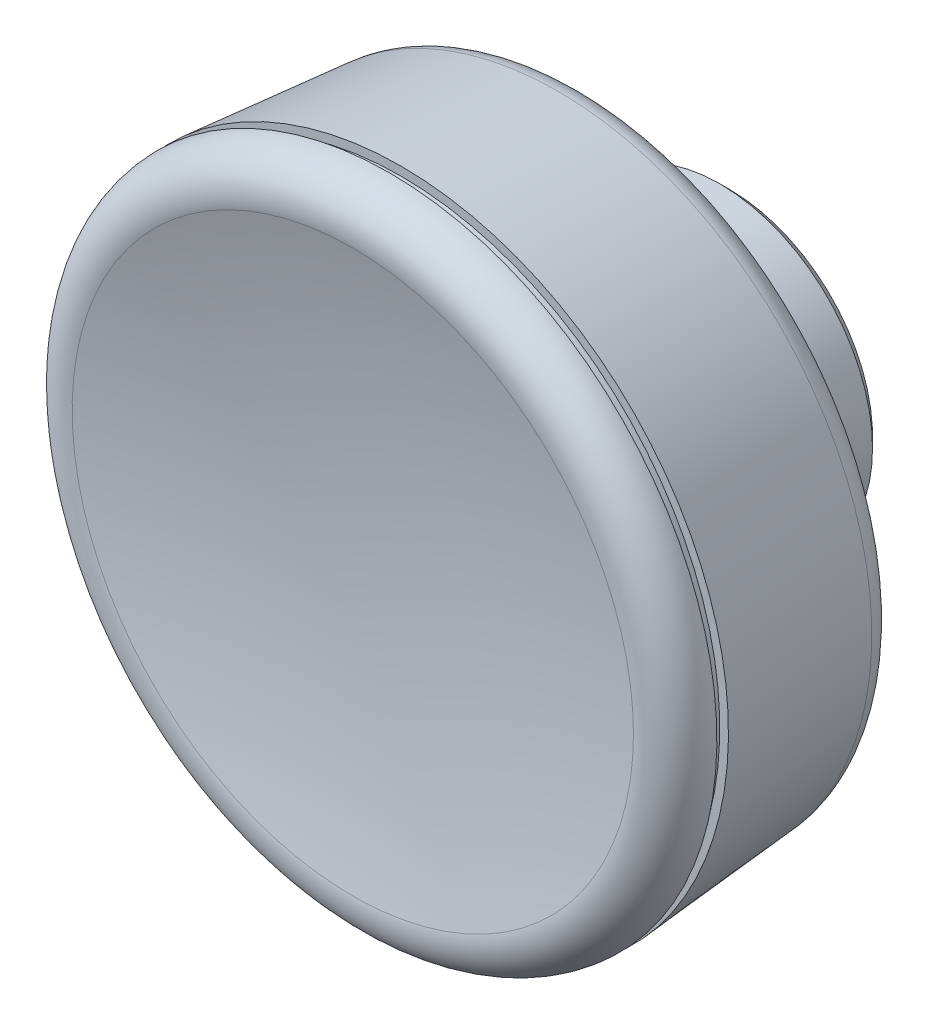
ISO-10303-21;
HEADER;
FILE_DESCRIPTION(('STEP AP214'),'2;1');
FILE_NAME('part.step','',(''),(''),'','','');
FILE_SCHEMA(('AUTOMOTIVE_DESIGN { 1 0 10303 214 1 1 1 1 }'));
ENDSEC;
DATA;
#1=APPLICATION_CONTEXT('core data for automotive mechanical design processes');
#2=APPLICATION_PROTOCOL_DEFINITION('international standard','automotive_design',2000,#1);
#3=PRODUCT_CONTEXT('',#1,'mechanical');
#4=PRODUCT('Part','Part','',(#3));
#5=PRODUCT_RELATED_PRODUCT_CATEGORY('part','',(#4));
#6=PRODUCT_DEFINITION_FORMATION('','',#4);
#7=PRODUCT_DEFINITION_CONTEXT('part definition',#1,'design');
#8=PRODUCT_DEFINITION('design','',#6,#7);
#9=PRODUCT_DEFINITION_SHAPE('','',#8);
#10=(LENGTH_UNIT() NAMED_UNIT(*) SI_UNIT(.MILLI.,.METRE.));
#11=(NAMED_UNIT(*) PLANE_ANGLE_UNIT() SI_UNIT($,.RADIAN.));
#12=(NAMED_UNIT(*) SI_UNIT($,.STERADIAN.) SOLID_ANGLE_UNIT());
#13=UNCERTAINTY_MEASURE_WITH_UNIT(LENGTH_MEASURE(1.E-05),#10,'distance_accuracy_value','');
#14=(GEOMETRIC_REPRESENTATION_CONTEXT(3) GLOBAL_UNCERTAINTY_ASSIGNED_CONTEXT((#13)) GLOBAL_UNIT_ASSIGNED_CONTEXT((#10,
#11,#12)) REPRESENTATION_CONTEXT('',''));
#15=CARTESIAN_POINT('',(0.,0.,0.));
#16=DIRECTION('',(0.,0.,1.));
#17=DIRECTION('',(1.,0.,0.));
#18=AXIS2_PLACEMENT_3D('',#15,#16,#17);
#19=CARTESIAN_POINT('',(0.,0.,106.143396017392));
#20=DIRECTION('',(0.,0.,-1.));
#21=DIRECTION('',(1.,0.,0.));
#22=AXIS2_PLACEMENT_3D('',#19,#20,#21);
#23=SPHERICAL_SURFACE('',#22,82.5);
#24=CARTESIAN_POINT('',(0.,0.,25.9307460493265));
#25=DIRECTION('',(0.,0.,-1.));
#26=DIRECTION('',(0.,1.,0.));
#27=AXIS2_PLACEMENT_3D('',#24,#25,#26);
#28=CIRCLE('',#27,19.2919875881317);
#29=CARTESIAN_POINT('',(0.,19.2919875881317,25.9307460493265));
#30=VERTEX_POINT('',#29);
#31=EDGE_CURVE('E49',#30,#30,#28,.T.);
#32=ORIENTED_EDGE('',*,*,#31,.F.);
#33=EDGE_LOOP('',(#32));
#34=FACE_BOUND('',#33,.T.);
#35=ADVANCED_FACE('F12',(#34),#23,.F.);
#36=CARTESIAN_POINT('',(9.79676461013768,0.,0.));
#37=DIRECTION('',(0.,0.,-1.));
#38=DIRECTION('',(0.,1.,0.));
#39=AXIS2_PLACEMENT_3D('',#36,#37,#38);
#40=PLANE('',#39);
#41=CARTESIAN_POINT('',(0.,0.,0.));
#42=DIRECTION('',(0.,0.,-1.));
#43=DIRECTION('',(0.,1.,0.));
#44=AXIS2_PLACEMENT_3D('',#41,#42,#43);
#45=CIRCLE('',#44,4.);
#46=CARTESIAN_POINT('',(0.,4.,0.));
#47=VERTEX_POINT('',#46);
#48=EDGE_CURVE('E55',#47,#47,#45,.T.);
#49=ORIENTED_EDGE('',*,*,#48,.F.);
#50=EDGE_LOOP('',(#49));
#51=FACE_BOUND('',#50,.T.);
#52=CARTESIAN_POINT('',(0.,0.,0.));
#53=DIRECTION('',(0.,0.,-1.));
#54=DIRECTION('',(0.,1.,0.));
#55=AXIS2_PLACEMENT_3D('',#52,#53,#54);
#56=CIRCLE('',#55,9.79676461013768);
#57=CARTESIAN_POINT('',(0.,9.79676461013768,0.));
#58=VERTEX_POINT('',#57);
#59=EDGE_CURVE('E8',#58,#58,#56,.T.);
#60=ORIENTED_EDGE('',*,*,#59,.T.);
#61=EDGE_LOOP('',(#60));
#62=FACE_BOUND('',#61,.T.);
#63=ADVANCED_FACE('F61',(#51,#62),#40,.T.);
#64=CARTESIAN_POINT('',(0.,0.,0.));
#65=DIRECTION('',(0.,0.,1.));
#66=DIRECTION('',(0.,-1.,0.));
#67=AXIS2_PLACEMENT_3D('',#64,#65,#66);
#68=CONICAL_SURFACE('',#67,9.79676461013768,0.785398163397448);
#69=CARTESIAN_POINT('',(0.,0.,0.700000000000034));
#70=DIRECTION('',(0.,0.,-1.));
#71=DIRECTION('',(0.,1.,0.));
#72=AXIS2_PLACEMENT_3D('',#69,#70,#71);
#73=CIRCLE('',#72,10.4967646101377);
#74=CARTESIAN_POINT('',(0.,10.4967646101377,0.700000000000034));
#75=VERTEX_POINT('',#74);
#76=EDGE_CURVE('E18',#75,#75,#73,.T.);
#77=ORIENTED_EDGE('',*,*,#76,.T.);
#78=EDGE_LOOP('',(#77));
#79=FACE_BOUND('',#78,.T.);
#80=ORIENTED_EDGE('',*,*,#59,.F.);
#81=EDGE_LOOP('',(#80));
#82=FACE_BOUND('',#81,.T.);
#83=ADVANCED_FACE('F63',(#79,#82),#68,.T.);
#84=CARTESIAN_POINT('',(0.,0.,0.));
#85=DIRECTION('',(0.,0.,-1.));
#86=DIRECTION('',(0.,1.,0.));
#87=AXIS2_PLACEMENT_3D('',#84,#85,#86);
#88=CYLINDRICAL_SURFACE('',#87,10.4967646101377);
#89=CARTESIAN_POINT('',(0.,0.,9.06177687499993));
#90=DIRECTION('',(0.,0.,-1.));
#91=DIRECTION('',(0.,1.,0.));
#92=AXIS2_PLACEMENT_3D('',#89,#90,#91);
#93=CIRCLE('',#92,10.4967646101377);
#94=CARTESIAN_POINT('',(0.,10.4967646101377,9.06177687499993));
#95=VERTEX_POINT('',#94);
#96=EDGE_CURVE('E22',#95,#95,#93,.T.);
#97=ORIENTED_EDGE('',*,*,#96,.T.);
#98=EDGE_LOOP('',(#97));
#99=FACE_BOUND('',#98,.T.);
#100=ORIENTED_EDGE('',*,*,#76,.F.);
#101=EDGE_LOOP('',(#100));
#102=FACE_BOUND('',#101,.T.);
#103=ADVANCED_FACE('F70',(#99,#102),#88,.T.);
#104=CARTESIAN_POINT('',(0.,0.,9.06177687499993));
#105=DIRECTION('',(0.,0.,-1.));
#106=DIRECTION('',(0.,1.,0.));
#107=AXIS2_PLACEMENT_3D('',#104,#105,#106);
#108=TOROIDAL_SURFACE('',#107,11.4342646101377,0.937500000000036);
#109=CARTESIAN_POINT('',(0.,0.,9.99927687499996));
#110=DIRECTION('',(0.,0.,-1.));
#111=DIRECTION('',(0.,1.,0.));
#112=AXIS2_PLACEMENT_3D('',#109,#110,#111);
#113=CIRCLE('',#112,11.4342646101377);
#114=CARTESIAN_POINT('',(0.,11.4342646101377,9.99927687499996));
#115=VERTEX_POINT('',#114);
#116=EDGE_CURVE('E26',#115,#115,#113,.T.);
#117=ORIENTED_EDGE('',*,*,#116,.T.);
#118=EDGE_LOOP('',(#117));
#119=FACE_BOUND('',#118,.T.);
#120=ORIENTED_EDGE('',*,*,#96,.F.);
#121=EDGE_LOOP('',(#120));
#122=FACE_BOUND('',#121,.T.);
#123=ADVANCED_FACE('F76',(#119,#122),#108,.F.);
#124=CARTESIAN_POINT('',(11.4342646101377,0.,9.99927687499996));
#125=DIRECTION('',(0.,0.,-1.));
#126=DIRECTION('',(0.,1.,0.));
#127=AXIS2_PLACEMENT_3D('',#124,#125,#126);
#128=PLANE('',#127);
#129=CARTESIAN_POINT('',(0.,0.,9.99927687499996));
#130=DIRECTION('',(0.,0.,-1.));
#131=DIRECTION('',(0.,1.,0.));
#132=AXIS2_PLACEMENT_3D('',#129,#130,#131);
#133=CIRCLE('',#132,19.5827925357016);
#134=CARTESIAN_POINT('',(0.,19.5827925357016,9.99927687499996));
#135=VERTEX_POINT('',#134);
#136=EDGE_CURVE('E31',#135,#135,#133,.T.);
#137=ORIENTED_EDGE('',*,*,#136,.T.);
#138=EDGE_LOOP('',(#137));
#139=FACE_BOUND('',#138,.T.);
#140=ORIENTED_EDGE('',*,*,#116,.F.);
#141=EDGE_LOOP('',(#140));
#142=FACE_BOUND('',#141,.T.);
#143=ADVANCED_FACE('F80',(#139,#142),#128,.T.);
#144=CARTESIAN_POINT('',(0.,0.,12.0082034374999));
#145=DIRECTION('',(0.,0.,-1.));
#146=DIRECTION('',(0.,1.,0.));
#147=AXIS2_PLACEMENT_3D('',#144,#145,#146);
#148=TOROIDAL_SURFACE('',#147,19.5827925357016,2.00892656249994);
#149=CARTESIAN_POINT('',(0.,0.,11.8381158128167));
#150=DIRECTION('',(0.,0.,-1.));
#151=DIRECTION('',(0.,1.,0.));
#152=AXIS2_PLACEMENT_3D('',#149,#150,#151);
#153=CIRCLE('',#152,21.5845058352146);
#154=CARTESIAN_POINT('',(0.,21.5845058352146,11.8381158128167));
#155=VERTEX_POINT('',#154);
#156=EDGE_CURVE('E34',#155,#155,#153,.T.);
#157=ORIENTED_EDGE('',*,*,#156,.T.);
#158=EDGE_LOOP('',(#157));
#159=FACE_BOUND('',#158,.T.);
#160=ORIENTED_EDGE('',*,*,#136,.F.);
#161=EDGE_LOOP('',(#160));
#162=FACE_BOUND('',#161,.T.);
#163=ADVANCED_FACE('F84',(#159,#162),#148,.T.);
#164=CARTESIAN_POINT('',(0.,0.,11.8381158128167));
#165=DIRECTION('',(0.,0.,1.));
#166=DIRECTION('',(0.,-1.,0.));
#167=AXIS2_PLACEMENT_3D('',#164,#165,#166);
#168=CONICAL_SURFACE('',#167,21.5845058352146,0.0847674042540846);
#169=CARTESIAN_POINT('',(0.,0.,22.6056900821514));
#170=DIRECTION('',(0.,0.,-1.));
#171=DIRECTION('',(0.,1.,0.));
#172=AXIS2_PLACEMENT_3D('',#169,#170,#171);
#173=CIRCLE('',#172,22.4994376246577);
#174=CARTESIAN_POINT('',(0.,22.4994376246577,22.6056900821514));
#175=VERTEX_POINT('',#174);
#176=EDGE_CURVE('E37',#175,#175,#173,.T.);
#177=ORIENTED_EDGE('',*,*,#176,.T.);
#178=EDGE_LOOP('',(#177));
#179=FACE_BOUND('',#178,.T.);
#180=ORIENTED_EDGE('',*,*,#156,.F.);
#181=EDGE_LOOP('',(#180));
#182=FACE_BOUND('',#181,.T.);
#183=ADVANCED_FACE('F88',(#179,#182),#168,.T.);
#184=CARTESIAN_POINT('',(21.9,0.,22.6056900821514));
#185=DIRECTION('',(0.,0.,1.));
#186=DIRECTION('',(0.,-1.,0.));
#187=AXIS2_PLACEMENT_3D('',#184,#185,#186);
#188=PLANE('',#187);
#189=CARTESIAN_POINT('',(0.,0.,22.6056900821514));
#190=DIRECTION('',(0.,0.,-1.));
#191=DIRECTION('',(0.,1.,0.));
#192=AXIS2_PLACEMENT_3D('',#189,#190,#191);
#193=CIRCLE('',#192,21.9);
#194=CARTESIAN_POINT('',(0.,21.9,22.6056900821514));
#195=VERTEX_POINT('',#194);
#196=EDGE_CURVE('E40',#195,#195,#193,.T.);
#197=ORIENTED_EDGE('',*,*,#196,.T.);
#198=EDGE_LOOP('',(#197));
#199=FACE_BOUND('',#198,.T.);
#200=ORIENTED_EDGE('',*,*,#176,.F.);
#201=EDGE_LOOP('',(#200));
#202=FACE_BOUND('',#201,.T.);
#203=ADVANCED_FACE('F92',(#199,#202),#188,.T.);
#204=CARTESIAN_POINT('',(0.,0.,0.));
#205=DIRECTION('',(0.,0.,-1.));
#206=DIRECTION('',(0.,1.,0.));
#207=AXIS2_PLACEMENT_3D('',#204,#205,#206);
#208=CYLINDRICAL_SURFACE('',#207,21.9);
#209=CARTESIAN_POINT('',(0.,0.,23.4028322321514));
#210=DIRECTION('',(0.,0.,-1.));
#211=DIRECTION('',(0.,1.,0.));
#212=AXIS2_PLACEMENT_3D('',#209,#210,#211);
#213=CIRCLE('',#212,21.9);
#214=CARTESIAN_POINT('',(0.,21.9,23.4028322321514));
#215=VERTEX_POINT('',#214);
#216=EDGE_CURVE('E43',#215,#215,#213,.T.);
#217=ORIENTED_EDGE('',*,*,#216,.T.);
#218=EDGE_LOOP('',(#217));
#219=FACE_BOUND('',#218,.T.);
#220=ORIENTED_EDGE('',*,*,#196,.F.);
#221=EDGE_LOOP('',(#220));
#222=FACE_BOUND('',#221,.T.);
#223=ADVANCED_FACE('F96',(#219,#222),#208,.T.);
#224=CARTESIAN_POINT('',(21.9,0.,23.4028322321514));
#225=DIRECTION('',(0.,0.,-1.));
#226=DIRECTION('',(0.,1.,0.));
#227=AXIS2_PLACEMENT_3D('',#224,#225,#226);
#228=PLANE('',#227);
#229=CARTESIAN_POINT('',(0.,0.,23.4028322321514));
#230=DIRECTION('',(0.,0.,-1.));
#231=DIRECTION('',(0.,1.,0.));
#232=AXIS2_PLACEMENT_3D('',#229,#230,#231);
#233=CIRCLE('',#232,22.4999775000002);
#234=CARTESIAN_POINT('',(0.,22.4999775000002,23.4028322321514));
#235=VERTEX_POINT('',#234);
#236=EDGE_CURVE('E46',#235,#235,#233,.T.);
#237=ORIENTED_EDGE('',*,*,#236,.T.);
#238=EDGE_LOOP('',(#237));
#239=FACE_BOUND('',#238,.T.);
#240=ORIENTED_EDGE('',*,*,#216,.F.);
#241=EDGE_LOOP('',(#240));
#242=FACE_BOUND('',#241,.T.);
#243=ADVANCED_FACE('F100',(#239,#242),#228,.T.);
#244=CARTESIAN_POINT('',(0.,0.,23.402832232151));
#245=DIRECTION('',(0.,0.,-1.));
#246=DIRECTION('',(0.,1.,0.));
#247=AXIS2_PLACEMENT_3D('',#244,#245,#246);
#248=TOROIDAL_SURFACE('',#247,19.8999775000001,2.60000000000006);
#249=ORIENTED_EDGE('',*,*,#31,.T.);
#250=EDGE_LOOP('',(#249));
#251=FACE_BOUND('',#250,.T.);
#252=ORIENTED_EDGE('',*,*,#236,.F.);
#253=EDGE_LOOP('',(#252));
#254=FACE_BOUND('',#253,.T.);
#255=ADVANCED_FACE('F104',(#251,#254),#248,.T.);
#256=CARTESIAN_POINT('',(0.,0.,14.));
#257=DIRECTION('',(0.,0.,-1.));
#258=DIRECTION('',(0.,1.,0.));
#259=AXIS2_PLACEMENT_3D('',#256,#257,#258);
#260=CYLINDRICAL_SURFACE('',#259,4.);
#261=CARTESIAN_POINT('',(0.,0.,14.));
#262=DIRECTION('',(0.,0.,-1.));
#263=DIRECTION('',(0.,1.,0.));
#264=AXIS2_PLACEMENT_3D('',#261,#262,#263);
#265=CIRCLE('',#264,4.);
#266=CARTESIAN_POINT('',(0.,4.,14.));
#267=VERTEX_POINT('',#266);
#268=EDGE_CURVE('E52',#267,#267,#265,.T.);
#269=ORIENTED_EDGE('',*,*,#268,.F.);
#270=EDGE_LOOP('',(#269));
#271=FACE_BOUND('',#270,.T.);
#272=ORIENTED_EDGE('',*,*,#48,.T.);
#273=EDGE_LOOP('',(#272));
#274=FACE_BOUND('',#273,.T.);
#275=ADVANCED_FACE('F59',(#271,#274),#260,.F.);
#276=CARTESIAN_POINT('',(0.,0.,14.));
#277=DIRECTION('',(0.,0.,-1.));
#278=DIRECTION('',(0.,1.,0.));
#279=AXIS2_PLACEMENT_3D('',#276,#277,#278);
#280=PLANE('',#279);
#281=ORIENTED_EDGE('',*,*,#268,.T.);
#282=EDGE_LOOP('',(#281));
#283=FACE_BOUND('',#282,.T.);
#284=ADVANCED_FACE('F111',(#283),#280,.T.);
#285=CLOSED_SHELL('',(#35,#63,#83,#103,#123,#143,#163,#183,#203,#223,#243,#255,#275,#284));
#286=MANIFOLD_SOLID_BREP('B1',#285);
#287=ADVANCED_BREP_SHAPE_REPRESENTATION('',(#18,#286),#14);
#288=SHAPE_DEFINITION_REPRESENTATION(#9,#287);
ENDSEC;
END-ISO-10303-21;
